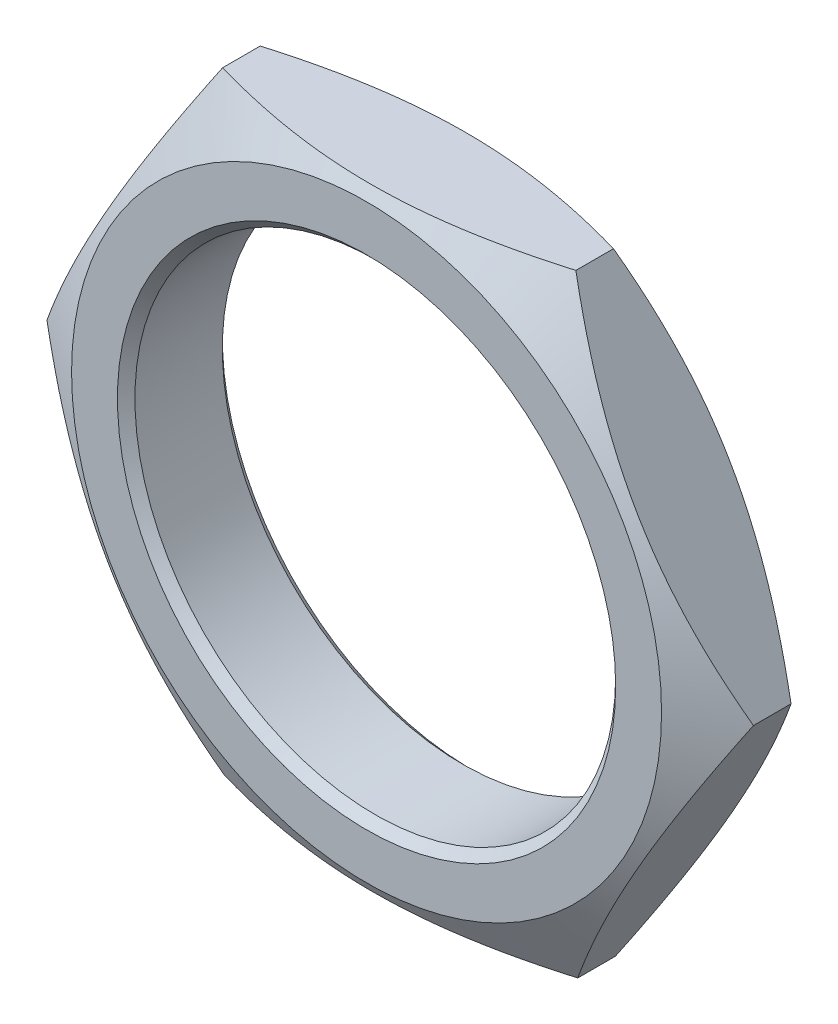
ISO-10303-21;
HEADER;
FILE_DESCRIPTION(('STEP AP214'),'2;1');
FILE_NAME('part.step','',(''),(''),'','','');
FILE_SCHEMA(('AUTOMOTIVE_DESIGN { 1 0 10303 214 1 1 1 1 }'));
ENDSEC;
DATA;
#1=APPLICATION_CONTEXT('core data for automotive mechanical design processes');
#2=APPLICATION_PROTOCOL_DEFINITION('international standard','automotive_design',2000,#1);
#3=PRODUCT_CONTEXT('',#1,'mechanical');
#4=PRODUCT('Part','Part','',(#3));
#5=PRODUCT_RELATED_PRODUCT_CATEGORY('part','',(#4));
#6=PRODUCT_DEFINITION_FORMATION('','',#4);
#7=PRODUCT_DEFINITION_CONTEXT('part definition',#1,'design');
#8=PRODUCT_DEFINITION('design','',#6,#7);
#9=PRODUCT_DEFINITION_SHAPE('','',#8);
#10=(LENGTH_UNIT() NAMED_UNIT(*) SI_UNIT(.MILLI.,.METRE.));
#11=(NAMED_UNIT(*) PLANE_ANGLE_UNIT() SI_UNIT($,.RADIAN.));
#12=(NAMED_UNIT(*) SI_UNIT($,.STERADIAN.) SOLID_ANGLE_UNIT());
#13=UNCERTAINTY_MEASURE_WITH_UNIT(LENGTH_MEASURE(1.E-05),#10,'distance_accuracy_value','');
#14=(GEOMETRIC_REPRESENTATION_CONTEXT(3) GLOBAL_UNCERTAINTY_ASSIGNED_CONTEXT((#13)) GLOBAL_UNIT_ASSIGNED_CONTEXT((#10,
#11,#12)) REPRESENTATION_CONTEXT('',''));
#15=CARTESIAN_POINT('',(0.,0.,0.));
#16=DIRECTION('',(0.,0.,1.));
#17=DIRECTION('',(1.,0.,0.));
#18=AXIS2_PLACEMENT_3D('',#15,#16,#17);
#19=CARTESIAN_POINT('',(-4.01970905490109,-7.01250828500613,2.4));
#20=DIRECTION('',(-0.00310333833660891,0.99999518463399,0.));
#21=DIRECTION('',(-0.99999518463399,-0.00310333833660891,0.));
#22=AXIS2_PLACEMENT_3D('',#19,#20,#21);
#23=PLANE('',#22);
#24=CARTESIAN_POINT('',(4.06335579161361,-6.98742367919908,0.769610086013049));
#25=CARTESIAN_POINT('',(3.88568555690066,-6.98797505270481,0.718328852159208));
#26=CARTESIAN_POINT('',(3.70735288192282,-6.9885284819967,0.669374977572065));
#27=CARTESIAN_POINT('',(3.34923928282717,-6.98963983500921,0.576762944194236));
#28=CARTESIAN_POINT('',(3.16945776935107,-6.99019776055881,0.533107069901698));
#29=CARTESIAN_POINT('',(2.62723473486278,-6.99188047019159,0.410943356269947));
#30=CARTESIAN_POINT('',(2.26265288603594,-6.99301189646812,0.341458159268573));
#31=CARTESIAN_POINT('',(1.7170627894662,-6.99470505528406,0.259978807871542));
#32=CARTESIAN_POINT('',(1.5376846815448,-6.9952617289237,0.236767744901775));
#33=CARTESIAN_POINT('',(1.17811796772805,-6.99637759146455,0.19784628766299));
#34=CARTESIAN_POINT('',(0.997929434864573,-6.9969367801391,0.1821352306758));
#35=CARTESIAN_POINT('',(0.637239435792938,-6.99805612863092,0.158614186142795));
#36=CARTESIAN_POINT('',(0.456738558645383,-6.99861628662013,0.150795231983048));
#37=CARTESIAN_POINT('',(0.0955800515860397,-6.99973708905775,0.143217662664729));
#38=CARTESIAN_POINT('',(-0.0850775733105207,-7.0002977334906,0.143458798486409));
#39=CARTESIAN_POINT('',(-0.580015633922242,-7.00183370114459,0.155198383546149));
#40=CARTESIAN_POINT('',(-0.894134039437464,-7.00280852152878,0.174904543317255));
#41=CARTESIAN_POINT('',(-1.52028451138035,-7.0047516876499,0.237391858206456));
#42=CARTESIAN_POINT('',(-1.83231437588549,-7.00572002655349,0.280194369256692));
#43=CARTESIAN_POINT('',(-2.4597248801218,-7.00766710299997,0.387187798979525));
#44=CARTESIAN_POINT('',(-2.77502635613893,-7.00864559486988,0.451832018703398));
#45=CARTESIAN_POINT('',(-3.40092738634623,-7.01058798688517,0.598548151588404));
#46=CARTESIAN_POINT('',(-3.71153495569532,-7.01155191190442,0.680585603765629));
#47=CARTESIAN_POINT('',(-4.01990905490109,-7.01250890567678,0.769610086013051));
#48=B_SPLINE_CURVE_WITH_KNOTS('',3,(#24,#25,#26,#27,#28,#29,#30,#31,#32,#33,#34,#35,#36,#37,#38,
#39,#40,#41,#42,#43,#44,#45,#46,#47),.UNSPECIFIED.,.F.,.F.,(4,2,2,2,2,2,2,2,2,2,2,4),(0.,
0.554726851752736,1.10969205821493,2.22192844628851,2.76442515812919,3.30687392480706,
3.8487056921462,4.39052071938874,5.3337433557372,6.27783963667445,7.24287417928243,
8.20601428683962),.UNSPECIFIED.);
#49=CARTESIAN_POINT('',(4.06315579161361,-6.98742429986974,0.769552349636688));
#50=VERTEX_POINT('',#49);
#51=CARTESIAN_POINT('',(-4.01970905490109,-7.01250828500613,0.76955234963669));
#52=VERTEX_POINT('',#51);
#53=EDGE_CURVE('E50',#50,#52,#48,.T.);
#54=ORIENTED_EDGE('',*,*,#53,.F.);
#55=DIRECTION('',(0.,0.,-1.));
#56=VECTOR('',#55,1.);
#57=CARTESIAN_POINT('',(4.06315579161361,-6.98742429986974,2.4));
#58=LINE('',#57,#56);
#59=CARTESIAN_POINT('',(4.06315579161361,-6.98742429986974,1.63044765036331));
#60=VERTEX_POINT('',#59);
#61=EDGE_CURVE('E120',#60,#50,#58,.T.);
#62=ORIENTED_EDGE('',*,*,#61,.F.);
#63=CARTESIAN_POINT('',(-4.01990905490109,-7.01250890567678,1.63038991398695));
#64=CARTESIAN_POINT('',(-3.84223882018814,-7.01195753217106,1.68167114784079));
#65=CARTESIAN_POINT('',(-3.6639061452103,-7.01140410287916,1.73062502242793));
#66=CARTESIAN_POINT('',(-3.30579254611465,-7.01029274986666,1.82323705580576));
#67=CARTESIAN_POINT('',(-3.12601103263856,-7.00973482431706,1.8668929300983));
#68=CARTESIAN_POINT('',(-2.58378799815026,-7.00805211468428,1.98905664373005));
#69=CARTESIAN_POINT('',(-2.21920614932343,-7.00692068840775,2.05854184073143));
#70=CARTESIAN_POINT('',(-1.67361605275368,-7.00522752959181,2.14002119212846));
#71=CARTESIAN_POINT('',(-1.49423794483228,-7.00467085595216,2.16323225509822));
#72=CARTESIAN_POINT('',(-1.13467123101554,-7.00355499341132,2.20215371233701));
#73=CARTESIAN_POINT('',(-0.954482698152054,-7.00299580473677,2.2178647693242));
#74=CARTESIAN_POINT('',(-0.59379269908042,-7.00187645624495,2.2413858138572));
#75=CARTESIAN_POINT('',(-0.413291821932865,-7.00131629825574,2.24920476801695));
#76=CARTESIAN_POINT('',(-0.0521333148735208,-7.00019549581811,2.25678233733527));
#77=CARTESIAN_POINT('',(0.128524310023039,-6.99963485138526,2.25654120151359));
#78=CARTESIAN_POINT('',(0.623462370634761,-6.99809888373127,2.24480161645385));
#79=CARTESIAN_POINT('',(0.937580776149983,-6.99712406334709,2.22509545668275));
#80=CARTESIAN_POINT('',(1.56373124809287,-6.99518089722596,2.16260814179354));
#81=CARTESIAN_POINT('',(1.87576111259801,-6.99421255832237,2.11980563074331));
#82=CARTESIAN_POINT('',(2.50317161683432,-6.9922654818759,2.01281220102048));
#83=CARTESIAN_POINT('',(2.81847309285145,-6.99128699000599,1.9481679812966));
#84=CARTESIAN_POINT('',(3.44437412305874,-6.98934459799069,1.8014518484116));
#85=CARTESIAN_POINT('',(3.75498169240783,-6.98838067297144,1.71941439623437));
#86=CARTESIAN_POINT('',(4.06335579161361,-6.98742367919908,1.63038991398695));
#87=B_SPLINE_CURVE_WITH_KNOTS('',3,(#63,#64,#65,#66,#67,#68,#69,#70,#71,#72,#73,#74,#75,#76,#77,
#78,#79,#80,#81,#82,#83,#84,#85,#86),.UNSPECIFIED.,.F.,.F.,(4,2,2,2,2,2,2,2,2,2,2,4),(0.,
0.554726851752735,1.10969205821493,2.22192844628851,2.76442515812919,3.30687392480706,
3.8487056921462,4.39052071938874,5.3337433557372,6.27783963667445,7.24287417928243,
8.20601428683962),.UNSPECIFIED.);
#88=CARTESIAN_POINT('',(-4.01970905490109,-7.01250828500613,1.63044765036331));
#89=VERTEX_POINT('',#88);
#90=EDGE_CURVE('E111',#89,#60,#87,.T.);
#91=ORIENTED_EDGE('',*,*,#90,.F.);
#92=DIRECTION('',(0.,0.,-1.));
#93=VECTOR('',#92,1.);
#94=CARTESIAN_POINT('',(-4.01970905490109,-7.01250828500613,2.4));
#95=LINE('',#94,#93);
#96=EDGE_CURVE('E107',#89,#52,#95,.T.);
#97=ORIENTED_EDGE('',*,*,#96,.T.);
#98=EDGE_LOOP('',(#54,#62,#91,#97));
#99=FACE_BOUND('',#98,.T.);
#100=ADVANCED_FACE('F35',(#99),#23,.F.);
#101=CARTESIAN_POINT('',(4.06315579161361,-6.98742429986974,2.4));
#102=DIRECTION('',(-0.86757290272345,0.497310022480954,0.));
#103=DIRECTION('',(-0.497310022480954,-0.86757290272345,0.));
#104=AXIS2_PLACEMENT_3D('',#101,#102,#103);
#105=PLANE('',#104);
#106=CARTESIAN_POINT('',(8.08297949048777,0.0252839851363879,0.769618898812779));
#107=CARTESIAN_POINT('',(7.99462174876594,-0.128858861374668,0.718337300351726));
#108=CARTESIAN_POINT('',(7.90593456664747,-0.283576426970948,0.669383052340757));
#109=CARTESIAN_POINT('',(7.72783996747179,-0.5942680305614,0.57677025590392));
#110=CARTESIAN_POINT('',(7.63843225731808,-0.750242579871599,0.533113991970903));
#111=CARTESIAN_POINT('',(7.36877760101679,-1.22066356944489,0.410949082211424));
#112=CARTESIAN_POINT('',(7.18746623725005,-1.53696691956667,0.341463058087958));
#113=CARTESIAN_POINT('',(6.91613708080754,-2.01030912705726,0.259982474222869));
#114=CARTESIAN_POINT('',(6.82692998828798,-2.16593369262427,0.236771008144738));
#115=CARTESIAN_POINT('',(6.64811272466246,-2.47788600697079,0.19784874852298));
#116=CARTESIAN_POINT('',(6.55850258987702,-2.63421369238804,0.182137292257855));
#117=CARTESIAN_POINT('',(6.37912668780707,-2.94714056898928,0.158615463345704));
#118=CARTESIAN_POINT('',(6.28936121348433,-3.10373924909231,0.150796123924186));
#119=CARTESIAN_POINT('',(6.10975230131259,-3.41707261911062,0.143217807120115));
#120=CARTESIAN_POINT('',(6.01990886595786,-3.57380730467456,0.143458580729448));
#121=CARTESIAN_POINT('',(5.77376761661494,-4.00320841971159,0.155197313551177));
#122=CARTESIAN_POINT('',(5.61755037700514,-4.27573428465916,0.174903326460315));
#123=CARTESIAN_POINT('',(5.30615347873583,-4.81897592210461,0.237391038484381));
#124=CARTESIAN_POINT('',(5.15097491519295,-5.08968978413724,0.28019409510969));
#125=CARTESIAN_POINT('',(4.83895134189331,-5.63402467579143,0.38718922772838));
#126=CARTESIAN_POINT('',(4.68214570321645,-5.90757702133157,0.451834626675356));
#127=CARTESIAN_POINT('',(4.37087282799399,-6.45060229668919,0.598553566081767));
#128=CARTESIAN_POINT('',(4.21640160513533,-6.7200821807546,0.680592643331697));
#129=CARTESIAN_POINT('',(4.06304114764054,-6.98762429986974,0.769618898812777));
#130=B_SPLINE_CURVE_WITH_KNOTS('',3,(#106,#107,#108,#109,#110,#111,#112,#113,#114,#115,#116,
#117,#118,#119,#120,#121,#122,#123,#124,#125,#126,#127,#128,#129),.UNSPECIFIED.,.F.,.F.,(4,2,2,
2,2,2,2,2,2,2,2,4),(0.,0.554727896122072,1.10969414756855,2.22193268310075,2.76443034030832,
3.30688005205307,3.84871275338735,4.39052871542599,5.33376486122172,6.27787470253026,
7.24292352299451,8.20607780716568),.UNSPECIFIED.);
#131=CARTESIAN_POINT('',(8.0828648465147,0.025083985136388,0.76955234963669));
#132=VERTEX_POINT('',#131);
#133=EDGE_CURVE('E184',#132,#50,#130,.T.);
#134=ORIENTED_EDGE('',*,*,#133,.F.);
#135=DIRECTION('',(0.,0.,-1.));
#136=VECTOR('',#135,1.);
#137=CARTESIAN_POINT('',(8.0828648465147,0.0250839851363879,2.4));
#138=LINE('',#137,#136);
#139=CARTESIAN_POINT('',(8.0828648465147,0.0250839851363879,1.63044765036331));
#140=VERTEX_POINT('',#139);
#141=EDGE_CURVE('E117',#140,#132,#138,.T.);
#142=ORIENTED_EDGE('',*,*,#141,.F.);
#143=CARTESIAN_POINT('',(4.06304114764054,-6.98762429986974,1.63038110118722));
#144=CARTESIAN_POINT('',(4.15139888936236,-6.83348145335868,1.68166269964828));
#145=CARTESIAN_POINT('',(4.24008607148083,-6.6787638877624,1.73061694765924));
#146=CARTESIAN_POINT('',(4.41818067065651,-6.36807228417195,1.82322974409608));
#147=CARTESIAN_POINT('',(4.50758838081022,-6.21209773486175,1.8668860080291));
#148=CARTESIAN_POINT('',(4.77724303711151,-5.74167674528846,1.98905091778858));
#149=CARTESIAN_POINT('',(4.95855440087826,-5.42537339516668,2.05853694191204));
#150=CARTESIAN_POINT('',(5.22988355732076,-4.95203118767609,2.14001752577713));
#151=CARTESIAN_POINT('',(5.31909064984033,-4.79640662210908,2.16322899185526));
#152=CARTESIAN_POINT('',(5.49790791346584,-4.48445430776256,2.20215125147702));
#153=CARTESIAN_POINT('',(5.58751804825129,-4.32812662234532,2.21786270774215));
#154=CARTESIAN_POINT('',(5.76689395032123,-4.01519974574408,2.2413845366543));
#155=CARTESIAN_POINT('',(5.85665942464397,-3.85860106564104,2.24920387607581));
#156=CARTESIAN_POINT('',(6.03626833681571,-3.54526769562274,2.25678219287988));
#157=CARTESIAN_POINT('',(6.12611177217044,-3.38853301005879,2.25654141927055));
#158=CARTESIAN_POINT('',(6.37225302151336,-2.95913189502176,2.24480268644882));
#159=CARTESIAN_POINT('',(6.52847026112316,-2.68660603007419,2.22509667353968));
#160=CARTESIAN_POINT('',(6.83986715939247,-2.14336439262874,2.16260896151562));
#161=CARTESIAN_POINT('',(6.99504572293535,-1.87265053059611,2.11980590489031));
#162=CARTESIAN_POINT('',(7.30706929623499,-1.32831563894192,2.01281077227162));
#163=CARTESIAN_POINT('',(7.46387493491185,-1.05476329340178,1.94816537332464));
#164=CARTESIAN_POINT('',(7.77514781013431,-0.511738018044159,1.80144643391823));
#165=CARTESIAN_POINT('',(7.92961903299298,-0.242258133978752,1.7194073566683));
#166=CARTESIAN_POINT('',(8.08297949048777,0.0252839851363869,1.63038110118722));
#167=B_SPLINE_CURVE_WITH_KNOTS('',3,(#143,#144,#145,#146,#147,#148,#149,#150,#151,#152,#153,
#154,#155,#156,#157,#158,#159,#160,#161,#162,#163,#164,#165,#166),.UNSPECIFIED.,.F.,.F.,(4,2,2,
2,2,2,2,2,2,2,2,4),(0.,0.554727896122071,1.10969414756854,2.22193268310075,2.76443034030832,
3.30688005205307,3.84871275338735,4.39052871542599,5.33376486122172,6.27787470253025,
7.24292352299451,8.20607780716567),.UNSPECIFIED.);
#168=EDGE_CURVE('E166',#60,#140,#167,.T.);
#169=ORIENTED_EDGE('',*,*,#168,.F.);
#170=ORIENTED_EDGE('',*,*,#61,.T.);
#171=EDGE_LOOP('',(#134,#142,#169,#170));
#172=FACE_BOUND('',#171,.T.);
#173=ADVANCED_FACE('F175',(#172),#105,.F.);
#174=CARTESIAN_POINT('',(8.0828648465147,0.0250839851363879,2.4));
#175=DIRECTION('',(-0.864469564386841,-0.502685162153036,0.));
#176=DIRECTION('',(0.502685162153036,-0.864469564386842,0.));
#177=AXIS2_PLACEMENT_3D('',#174,#175,#176);
#178=PLANE('',#177);
#179=CARTESIAN_POINT('',(4.01959275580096,7.01270828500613,0.769619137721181));
#180=CARTESIAN_POINT('',(4.10890550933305,6.85911680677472,0.718337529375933));
#181=CARTESIAN_POINT('',(4.19855126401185,6.70495266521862,0.669383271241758));
#182=CARTESIAN_POINT('',(4.37857079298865,6.39537240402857,0.576770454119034));
#183=CARTESIAN_POINT('',(4.46894486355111,6.23995577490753,0.533114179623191));
#184=CARTESIAN_POINT('',(4.74151407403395,5.77121747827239,0.410949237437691));
#185=CARTESIAN_POINT('',(4.92478513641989,5.45604554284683,0.341463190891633));
#186=CARTESIAN_POINT('',(5.19904694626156,4.984396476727,0.259982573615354));
#187=CARTESIAN_POINT('',(5.2892182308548,4.82932857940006,0.236771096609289));
#188=CARTESIAN_POINT('',(5.46996823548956,4.51849211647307,0.197848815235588));
#189=CARTESIAN_POINT('',(5.56054691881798,4.36272361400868,0.182137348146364));
#190=CARTESIAN_POINT('',(5.74186160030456,4.05091607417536,0.15861549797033));
#191=CARTESIAN_POINT('',(5.83259730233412,3.89487754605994,0.150796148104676));
#192=CARTESIAN_POINT('',(6.01414751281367,3.5826649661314,0.143217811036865));
#193=CARTESIAN_POINT('',(6.10496201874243,3.42649091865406,0.143458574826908));
#194=CARTESIAN_POINT('',(6.35376373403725,2.9986256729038,0.155197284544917));
#195=CARTESIAN_POINT('',(6.51166949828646,2.72707453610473,0.174903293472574));
#196=CARTESIAN_POINT('',(6.82643223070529,2.18577588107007,0.237391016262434));
#197=CARTESIAN_POINT('',(6.98328809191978,1.91603026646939,0.280194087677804));
#198=CARTESIAN_POINT('',(7.29868427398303,1.37364226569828,0.387189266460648));
#199=CARTESIAN_POINT('',(7.45718479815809,1.10106831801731,0.451834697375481));
#200=CARTESIAN_POINT('',(7.77182216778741,0.559985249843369,0.598553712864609));
#201=CARTESIAN_POINT('',(7.92796304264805,0.29146919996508,0.680592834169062));
#202=CARTESIAN_POINT('',(8.08298114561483,0.0248839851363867,0.769619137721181));
#203=B_SPLINE_CURVE_WITH_KNOTS('',3,(#179,#180,#181,#182,#183,#184,#185,#186,#187,#188,#189,
#190,#191,#192,#193,#194,#195,#196,#197,#198,#199,#200,#201,#202),.UNSPECIFIED.,.F.,.F.,(4,2,2,
2,2,2,2,2,2,2,2,4),(0.,0.554727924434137,1.10969420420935,2.22193279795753,2.76443048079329,
3.30688021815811,3.8487129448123,4.39052893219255,5.33376544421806,6.2778756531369,
7.24292486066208,8.20607952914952),.UNSPECIFIED.);
#204=CARTESIAN_POINT('',(4.01970905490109,7.01250828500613,0.76955234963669));
#205=VERTEX_POINT('',#204);
#206=EDGE_CURVE('E190',#205,#132,#203,.T.);
#207=ORIENTED_EDGE('',*,*,#206,.F.);
#208=DIRECTION('',(0.,0.,-1.));
#209=VECTOR('',#208,1.);
#210=CARTESIAN_POINT('',(4.01970905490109,7.01250828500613,2.4));
#211=LINE('',#210,#209);
#212=CARTESIAN_POINT('',(4.01970905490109,7.01250828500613,1.63044765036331));
#213=VERTEX_POINT('',#212);
#214=EDGE_CURVE('E109',#213,#205,#211,.T.);
#215=ORIENTED_EDGE('',*,*,#214,.F.);
#216=CARTESIAN_POINT('',(8.08298114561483,0.0248839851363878,1.63038086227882));
#217=CARTESIAN_POINT('',(7.99366839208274,0.178475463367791,1.68166247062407));
#218=CARTESIAN_POINT('',(7.90402263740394,0.332639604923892,1.73061672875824));
#219=CARTESIAN_POINT('',(7.72400310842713,0.642219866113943,1.82322954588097));
#220=CARTESIAN_POINT('',(7.63362903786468,0.797636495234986,1.86688582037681));
#221=CARTESIAN_POINT('',(7.36105982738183,1.26637479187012,1.98905076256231));
#222=CARTESIAN_POINT('',(7.1777887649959,1.58154672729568,2.05853680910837));
#223=CARTESIAN_POINT('',(6.90352695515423,2.05319579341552,2.14001742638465));
#224=CARTESIAN_POINT('',(6.81335567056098,2.20826369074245,2.16322890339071));
#225=CARTESIAN_POINT('',(6.63260566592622,2.51910015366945,2.20215118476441));
#226=CARTESIAN_POINT('',(6.54202698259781,2.67486865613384,2.21786265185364));
#227=CARTESIAN_POINT('',(6.36071230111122,2.98667619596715,2.24138450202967));
#228=CARTESIAN_POINT('',(6.26997659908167,3.14271472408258,2.24920385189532));
#229=CARTESIAN_POINT('',(6.08842638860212,3.45492730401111,2.25678218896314));
#230=CARTESIAN_POINT('',(5.99761188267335,3.61110135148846,2.25654142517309));
#231=CARTESIAN_POINT('',(5.74881016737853,4.03896659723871,2.24480271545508));
#232=CARTESIAN_POINT('',(5.59090440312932,4.31051773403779,2.22509670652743));
#233=CARTESIAN_POINT('',(5.27614167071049,4.85181638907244,2.16260898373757));
#234=CARTESIAN_POINT('',(5.119285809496,5.12156200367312,2.1198059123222));
#235=CARTESIAN_POINT('',(4.80388962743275,5.66395000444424,2.01281073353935));
#236=CARTESIAN_POINT('',(4.6453891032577,5.9365239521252,1.94816530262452));
#237=CARTESIAN_POINT('',(4.33075173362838,6.47760702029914,1.80144628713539));
#238=CARTESIAN_POINT('',(4.17461085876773,6.74612307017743,1.71940716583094));
#239=CARTESIAN_POINT('',(4.01959275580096,7.01270828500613,1.63038086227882));
#240=B_SPLINE_CURVE_WITH_KNOTS('',3,(#216,#217,#218,#219,#220,#221,#222,#223,#224,#225,#226,
#227,#228,#229,#230,#231,#232,#233,#234,#235,#236,#237,#238,#239),.UNSPECIFIED.,.F.,.F.,(4,2,2,
2,2,2,2,2,2,2,2,4),(0.,0.554727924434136,1.10969420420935,2.22193279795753,2.7644304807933,
3.30688021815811,3.8487129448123,4.39052893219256,5.33376544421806,6.2778756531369,
7.24292486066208,8.20607952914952),.UNSPECIFIED.);
#241=EDGE_CURVE('E160',#140,#213,#240,.T.);
#242=ORIENTED_EDGE('',*,*,#241,.F.);
#243=ORIENTED_EDGE('',*,*,#141,.T.);
#244=EDGE_LOOP('',(#207,#215,#242,#243));
#245=FACE_BOUND('',#244,.T.);
#246=ADVANCED_FACE('F178',(#245),#178,.F.);
#247=CARTESIAN_POINT('',(4.01970905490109,7.01250828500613,2.4));
#248=DIRECTION('',(0.00310333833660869,-0.99999518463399,0.));
#249=DIRECTION('',(0.99999518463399,0.00310333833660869,0.));
#250=AXIS2_PLACEMENT_3D('',#247,#248,#249);
#251=PLANE('',#250);
#252=CARTESIAN_POINT('',(-4.06335579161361,6.98742367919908,0.76961008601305));
#253=CARTESIAN_POINT('',(-3.88568555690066,6.98797505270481,0.718328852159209));
#254=CARTESIAN_POINT('',(-3.70735288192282,6.9885284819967,0.669374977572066));
#255=CARTESIAN_POINT('',(-3.34923928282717,6.98963983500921,0.576762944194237));
#256=CARTESIAN_POINT('',(-3.16945776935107,6.99019776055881,0.533107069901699));
#257=CARTESIAN_POINT('',(-2.62723473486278,6.99188047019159,0.410943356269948));
#258=CARTESIAN_POINT('',(-2.26265288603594,6.99301189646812,0.341458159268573));
#259=CARTESIAN_POINT('',(-1.7170627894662,6.99470505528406,0.259978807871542));
#260=CARTESIAN_POINT('',(-1.5376846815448,6.99526172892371,0.236767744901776));
#261=CARTESIAN_POINT('',(-1.17811796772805,6.99637759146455,0.197846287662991));
#262=CARTESIAN_POINT('',(-0.997929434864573,6.9969367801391,0.1821352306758));
#263=CARTESIAN_POINT('',(-0.637239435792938,6.99805612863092,0.158614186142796));
#264=CARTESIAN_POINT('',(-0.456738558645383,6.99861628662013,0.150795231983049));
#265=CARTESIAN_POINT('',(-0.0955800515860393,6.99973708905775,0.143217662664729));
#266=CARTESIAN_POINT('',(0.085077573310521,7.0002977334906,0.143458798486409));
#267=CARTESIAN_POINT('',(0.580015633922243,7.00183370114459,0.15519838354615));
#268=CARTESIAN_POINT('',(0.894134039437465,7.00280852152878,0.174904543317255));
#269=CARTESIAN_POINT('',(1.52028451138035,7.0047516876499,0.237391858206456));
#270=CARTESIAN_POINT('',(1.83231437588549,7.00572002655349,0.280194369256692));
#271=CARTESIAN_POINT('',(2.4597248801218,7.00766710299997,0.387187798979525));
#272=CARTESIAN_POINT('',(2.77502635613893,7.00864559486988,0.451832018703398));
#273=CARTESIAN_POINT('',(3.40092738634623,7.01058798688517,0.598548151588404));
#274=CARTESIAN_POINT('',(3.71153495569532,7.01155191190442,0.680585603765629));
#275=CARTESIAN_POINT('',(4.01990905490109,7.01250890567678,0.769610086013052));
#276=B_SPLINE_CURVE_WITH_KNOTS('',3,(#252,#253,#254,#255,#256,#257,#258,#259,#260,#261,#262,
#263,#264,#265,#266,#267,#268,#269,#270,#271,#272,#273,#274,#275),.UNSPECIFIED.,.F.,.F.,(4,2,2,
2,2,2,2,2,2,2,2,4),(0.,0.554726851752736,1.10969205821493,2.22192844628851,2.76442515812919,
3.30687392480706,3.8487056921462,4.39052071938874,5.3337433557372,6.27783963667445,
7.24287417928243,8.20601428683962),.UNSPECIFIED.);
#277=CARTESIAN_POINT('',(-4.06315579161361,6.98742429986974,0.769552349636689));
#278=VERTEX_POINT('',#277);
#279=EDGE_CURVE('E103',#278,#205,#276,.T.);
#280=ORIENTED_EDGE('',*,*,#279,.F.);
#281=DIRECTION('',(0.,0.,-1.));
#282=VECTOR('',#281,1.);
#283=CARTESIAN_POINT('',(-4.06315579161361,6.98742429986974,2.4));
#284=LINE('',#283,#282);
#285=CARTESIAN_POINT('',(-4.06315579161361,6.98742429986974,1.63044765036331));
#286=VERTEX_POINT('',#285);
#287=EDGE_CURVE('E102',#286,#278,#284,.T.);
#288=ORIENTED_EDGE('',*,*,#287,.F.);
#289=CARTESIAN_POINT('',(4.01990905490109,7.01250890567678,1.63038991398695));
#290=CARTESIAN_POINT('',(3.84223882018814,7.01195753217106,1.68167114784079));
#291=CARTESIAN_POINT('',(3.6639061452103,7.01140410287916,1.73062502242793));
#292=CARTESIAN_POINT('',(3.30579254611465,7.01029274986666,1.82323705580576));
#293=CARTESIAN_POINT('',(3.12601103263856,7.00973482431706,1.8668929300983));
#294=CARTESIAN_POINT('',(2.58378799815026,7.00805211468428,1.98905664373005));
#295=CARTESIAN_POINT('',(2.21920614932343,7.00692068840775,2.05854184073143));
#296=CARTESIAN_POINT('',(1.67361605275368,7.00522752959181,2.14002119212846));
#297=CARTESIAN_POINT('',(1.49423794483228,7.00467085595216,2.16323225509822));
#298=CARTESIAN_POINT('',(1.13467123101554,7.00355499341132,2.20215371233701));
#299=CARTESIAN_POINT('',(0.954482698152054,7.00299580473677,2.2178647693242));
#300=CARTESIAN_POINT('',(0.593792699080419,7.00187645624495,2.2413858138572));
#301=CARTESIAN_POINT('',(0.413291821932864,7.00131629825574,2.24920476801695));
#302=CARTESIAN_POINT('',(0.0521333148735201,7.00019549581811,2.25678233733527));
#303=CARTESIAN_POINT('',(-0.12852431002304,6.99963485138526,2.25654120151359));
#304=CARTESIAN_POINT('',(-0.623462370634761,6.99809888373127,2.24480161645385));
#305=CARTESIAN_POINT('',(-0.937580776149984,6.99712406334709,2.22509545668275));
#306=CARTESIAN_POINT('',(-1.56373124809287,6.99518089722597,2.16260814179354));
#307=CARTESIAN_POINT('',(-1.87576111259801,6.99421255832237,2.11980563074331));
#308=CARTESIAN_POINT('',(-2.50317161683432,6.9922654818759,2.01281220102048));
#309=CARTESIAN_POINT('',(-2.81847309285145,6.99128699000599,1.9481679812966));
#310=CARTESIAN_POINT('',(-3.44437412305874,6.9893445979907,1.8014518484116));
#311=CARTESIAN_POINT('',(-3.75498169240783,6.98838067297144,1.71941439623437));
#312=CARTESIAN_POINT('',(-4.06335579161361,6.98742367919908,1.63038991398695));
#313=B_SPLINE_CURVE_WITH_KNOTS('',3,(#289,#290,#291,#292,#293,#294,#295,#296,#297,#298,#299,
#300,#301,#302,#303,#304,#305,#306,#307,#308,#309,#310,#311,#312),.UNSPECIFIED.,.F.,.F.,(4,2,2,
2,2,2,2,2,2,2,2,4),(0.,0.554726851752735,1.10969205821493,2.22192844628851,2.76442515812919,
3.30687392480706,3.84870569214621,4.39052071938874,5.3337433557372,6.27783963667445,
7.24287417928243,8.20601428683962),.UNSPECIFIED.);
#314=EDGE_CURVE('E154',#213,#286,#313,.T.);
#315=ORIENTED_EDGE('',*,*,#314,.F.);
#316=ORIENTED_EDGE('',*,*,#214,.T.);
#317=EDGE_LOOP('',(#280,#288,#315,#316));
#318=FACE_BOUND('',#317,.T.);
#319=ADVANCED_FACE('F209',(#318),#251,.F.);
#320=CARTESIAN_POINT('',(-4.06315579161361,6.98742429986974,2.4));
#321=DIRECTION('',(0.86757290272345,-0.497310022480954,0.));
#322=DIRECTION('',(0.497310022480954,0.86757290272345,0.));
#323=AXIS2_PLACEMENT_3D('',#320,#321,#322);
#324=PLANE('',#323);
#325=CARTESIAN_POINT('',(-8.08297949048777,-0.025283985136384,0.769618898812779));
#326=CARTESIAN_POINT('',(-7.99462174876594,0.128858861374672,0.718337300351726));
#327=CARTESIAN_POINT('',(-7.90593456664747,0.283576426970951,0.669383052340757));
#328=CARTESIAN_POINT('',(-7.72783996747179,0.594268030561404,0.57677025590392));
#329=CARTESIAN_POINT('',(-7.63843225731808,0.750242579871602,0.533113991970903));
#330=CARTESIAN_POINT('',(-7.36877760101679,1.22066356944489,0.410949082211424));
#331=CARTESIAN_POINT('',(-7.18746623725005,1.53696691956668,0.341463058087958));
#332=CARTESIAN_POINT('',(-6.91613708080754,2.01030912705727,0.259982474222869));
#333=CARTESIAN_POINT('',(-6.82692998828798,2.16593369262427,0.236771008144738));
#334=CARTESIAN_POINT('',(-6.64811272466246,2.47788600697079,0.197848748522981));
#335=CARTESIAN_POINT('',(-6.55850258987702,2.63421369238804,0.182137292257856));
#336=CARTESIAN_POINT('',(-6.37912668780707,2.94714056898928,0.158615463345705));
#337=CARTESIAN_POINT('',(-6.28936121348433,3.10373924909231,0.150796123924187));
#338=CARTESIAN_POINT('',(-6.10975230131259,3.41707261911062,0.143217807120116));
#339=CARTESIAN_POINT('',(-6.01990886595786,3.57380730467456,0.143458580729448));
#340=CARTESIAN_POINT('',(-5.77376761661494,4.0032084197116,0.155197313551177));
#341=CARTESIAN_POINT('',(-5.61755037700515,4.27573428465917,0.174903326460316));
#342=CARTESIAN_POINT('',(-5.30615347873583,4.81897592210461,0.237391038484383));
#343=CARTESIAN_POINT('',(-5.15097491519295,5.08968978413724,0.280194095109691));
#344=CARTESIAN_POINT('',(-4.83895134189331,5.63402467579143,0.387189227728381));
#345=CARTESIAN_POINT('',(-4.68214570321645,5.90757702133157,0.451834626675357));
#346=CARTESIAN_POINT('',(-4.37087282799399,6.45060229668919,0.598553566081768));
#347=CARTESIAN_POINT('',(-4.21640160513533,6.7200821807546,0.680592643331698));
#348=CARTESIAN_POINT('',(-4.06304114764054,6.98762429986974,0.769618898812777));
#349=B_SPLINE_CURVE_WITH_KNOTS('',3,(#325,#326,#327,#328,#329,#330,#331,#332,#333,#334,#335,
#336,#337,#338,#339,#340,#341,#342,#343,#344,#345,#346,#347,#348),.UNSPECIFIED.,.F.,.F.,(4,2,2,
2,2,2,2,2,2,2,2,4),(0.,0.554727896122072,1.10969414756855,2.22193268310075,2.76443034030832,
3.30688005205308,3.84871275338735,4.39052871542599,5.33376486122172,6.27787470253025,
7.24292352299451,8.20607780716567),.UNSPECIFIED.);
#350=CARTESIAN_POINT('',(-8.0828648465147,-0.0250839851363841,0.76955234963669));
#351=VERTEX_POINT('',#350);
#352=EDGE_CURVE('E88',#351,#278,#349,.T.);
#353=ORIENTED_EDGE('',*,*,#352,.F.);
#354=DIRECTION('',(0.,0.,-1.));
#355=VECTOR('',#354,1.);
#356=CARTESIAN_POINT('',(-8.0828648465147,-0.025083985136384,2.4));
#357=LINE('',#356,#355);
#358=CARTESIAN_POINT('',(-8.0828648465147,-0.025083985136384,1.63044765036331));
#359=VERTEX_POINT('',#358);
#360=EDGE_CURVE('E100',#359,#351,#357,.T.);
#361=ORIENTED_EDGE('',*,*,#360,.F.);
#362=CARTESIAN_POINT('',(-4.06304114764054,6.98762429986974,1.63038110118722));
#363=CARTESIAN_POINT('',(-4.15139888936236,6.83348145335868,1.68166269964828));
#364=CARTESIAN_POINT('',(-4.24008607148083,6.67876388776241,1.73061694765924));
#365=CARTESIAN_POINT('',(-4.41818067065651,6.36807228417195,1.82322974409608));
#366=CARTESIAN_POINT('',(-4.50758838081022,6.21209773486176,1.8668860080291));
#367=CARTESIAN_POINT('',(-4.77724303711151,5.74167674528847,1.98905091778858));
#368=CARTESIAN_POINT('',(-4.95855440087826,5.42537339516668,2.05853694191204));
#369=CARTESIAN_POINT('',(-5.22988355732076,4.95203118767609,2.14001752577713));
#370=CARTESIAN_POINT('',(-5.31909064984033,4.79640662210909,2.16322899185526));
#371=CARTESIAN_POINT('',(-5.49790791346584,4.48445430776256,2.20215125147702));
#372=CARTESIAN_POINT('',(-5.58751804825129,4.32812662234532,2.21786270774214));
#373=CARTESIAN_POINT('',(-5.76689395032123,4.01519974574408,2.24138453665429));
#374=CARTESIAN_POINT('',(-5.85665942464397,3.85860106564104,2.24920387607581));
#375=CARTESIAN_POINT('',(-6.03626833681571,3.54526769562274,2.25678219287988));
#376=CARTESIAN_POINT('',(-6.12611177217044,3.3885330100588,2.25654141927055));
#377=CARTESIAN_POINT('',(-6.37225302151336,2.95913189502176,2.24480268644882));
#378=CARTESIAN_POINT('',(-6.52847026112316,2.68660603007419,2.22509667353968));
#379=CARTESIAN_POINT('',(-6.83986715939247,2.14336439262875,2.16260896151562));
#380=CARTESIAN_POINT('',(-6.99504572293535,1.87265053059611,2.11980590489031));
#381=CARTESIAN_POINT('',(-7.30706929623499,1.32831563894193,2.01281077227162));
#382=CARTESIAN_POINT('',(-7.46387493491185,1.05476329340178,1.94816537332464));
#383=CARTESIAN_POINT('',(-7.77514781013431,0.511738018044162,1.80144643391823));
#384=CARTESIAN_POINT('',(-7.92961903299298,0.242258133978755,1.7194073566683));
#385=CARTESIAN_POINT('',(-8.08297949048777,-0.0252839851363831,1.63038110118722));
#386=B_SPLINE_CURVE_WITH_KNOTS('',3,(#362,#363,#364,#365,#366,#367,#368,#369,#370,#371,#372,
#373,#374,#375,#376,#377,#378,#379,#380,#381,#382,#383,#384,#385),.UNSPECIFIED.,.F.,.F.,(4,2,2,
2,2,2,2,2,2,2,2,4),(0.,0.554727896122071,1.10969414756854,2.22193268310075,2.76443034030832,
3.30688005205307,3.84871275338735,4.39052871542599,5.33376486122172,6.27787470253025,
7.24292352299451,8.20607780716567),.UNSPECIFIED.);
#387=EDGE_CURVE('E58',#286,#359,#386,.T.);
#388=ORIENTED_EDGE('',*,*,#387,.F.);
#389=ORIENTED_EDGE('',*,*,#287,.T.);
#390=EDGE_LOOP('',(#353,#361,#388,#389));
#391=FACE_BOUND('',#390,.T.);
#392=ADVANCED_FACE('F99',(#391),#324,.F.);
#393=CARTESIAN_POINT('',(-8.0828648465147,-0.025083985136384,2.4));
#394=DIRECTION('',(0.864469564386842,0.502685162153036,0.));
#395=DIRECTION('',(-0.502685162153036,0.864469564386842,0.));
#396=AXIS2_PLACEMENT_3D('',#393,#394,#395);
#397=PLANE('',#396);
#398=CARTESIAN_POINT('',(-4.01959275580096,-7.01270828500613,0.769619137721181));
#399=CARTESIAN_POINT('',(-4.10890550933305,-6.85911680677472,0.718337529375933));
#400=CARTESIAN_POINT('',(-4.19855126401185,-6.70495266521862,0.669383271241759));
#401=CARTESIAN_POINT('',(-4.37857079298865,-6.39537240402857,0.576770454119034));
#402=CARTESIAN_POINT('',(-4.4689448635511,-6.23995577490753,0.533114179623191));
#403=CARTESIAN_POINT('',(-4.74151407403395,-5.77121747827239,0.41094923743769));
#404=CARTESIAN_POINT('',(-4.92478513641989,-5.45604554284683,0.341463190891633));
#405=CARTESIAN_POINT('',(-5.19904694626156,-4.984396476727,0.259982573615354));
#406=CARTESIAN_POINT('',(-5.2892182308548,-4.82932857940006,0.236771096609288));
#407=CARTESIAN_POINT('',(-5.46996823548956,-4.51849211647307,0.197848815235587));
#408=CARTESIAN_POINT('',(-5.56054691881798,-4.36272361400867,0.182137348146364));
#409=CARTESIAN_POINT('',(-5.74186160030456,-4.05091607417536,0.15861549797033));
#410=CARTESIAN_POINT('',(-5.83259730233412,-3.89487754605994,0.150796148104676));
#411=CARTESIAN_POINT('',(-6.01414751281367,-3.5826649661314,0.143217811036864));
#412=CARTESIAN_POINT('',(-6.10496201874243,-3.42649091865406,0.143458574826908));
#413=CARTESIAN_POINT('',(-6.35376373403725,-2.9986256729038,0.155197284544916));
#414=CARTESIAN_POINT('',(-6.51166949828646,-2.72707453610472,0.174903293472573));
#415=CARTESIAN_POINT('',(-6.82643223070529,-2.18577588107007,0.237391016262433));
#416=CARTESIAN_POINT('',(-6.98328809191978,-1.91603026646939,0.280194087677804));
#417=CARTESIAN_POINT('',(-7.29868427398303,-1.37364226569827,0.387189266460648));
#418=CARTESIAN_POINT('',(-7.45718479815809,-1.10106831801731,0.451834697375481));
#419=CARTESIAN_POINT('',(-7.77182216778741,-0.559985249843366,0.598553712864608));
#420=CARTESIAN_POINT('',(-7.92796304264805,-0.291469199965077,0.680592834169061));
#421=CARTESIAN_POINT('',(-8.08298114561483,-0.0248839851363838,0.769619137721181));
#422=B_SPLINE_CURVE_WITH_KNOTS('',3,(#398,#399,#400,#401,#402,#403,#404,#405,#406,#407,#408,
#409,#410,#411,#412,#413,#414,#415,#416,#417,#418,#419,#420,#421),.UNSPECIFIED.,.F.,.F.,(4,2,2,
2,2,2,2,2,2,2,2,4),(0.,0.554727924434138,1.10969420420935,2.22193279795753,2.7644304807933,
3.30688021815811,3.8487129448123,4.39052893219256,5.33376544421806,6.2778756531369,
7.24292486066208,8.20607952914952),.UNSPECIFIED.);
#423=EDGE_CURVE('E85',#52,#351,#422,.T.);
#424=ORIENTED_EDGE('',*,*,#423,.F.);
#425=ORIENTED_EDGE('',*,*,#96,.F.);
#426=CARTESIAN_POINT('',(-8.08298114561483,-0.0248839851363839,1.63038086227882));
#427=CARTESIAN_POINT('',(-7.99366839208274,-0.178475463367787,1.68166247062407));
#428=CARTESIAN_POINT('',(-7.90402263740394,-0.332639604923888,1.73061672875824));
#429=CARTESIAN_POINT('',(-7.72400310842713,-0.64221986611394,1.82322954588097));
#430=CARTESIAN_POINT('',(-7.63362903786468,-0.797636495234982,1.86688582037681));
#431=CARTESIAN_POINT('',(-7.36105982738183,-1.26637479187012,1.98905076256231));
#432=CARTESIAN_POINT('',(-7.1777887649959,-1.58154672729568,2.05853680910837));
#433=CARTESIAN_POINT('',(-6.90352695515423,-2.05319579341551,2.14001742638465));
#434=CARTESIAN_POINT('',(-6.81335567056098,-2.20826369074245,2.16322890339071));
#435=CARTESIAN_POINT('',(-6.63260566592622,-2.51910015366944,2.20215118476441));
#436=CARTESIAN_POINT('',(-6.54202698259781,-2.67486865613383,2.21786265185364));
#437=CARTESIAN_POINT('',(-6.36071230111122,-2.98667619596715,2.24138450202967));
#438=CARTESIAN_POINT('',(-6.26997659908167,-3.14271472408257,2.24920385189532));
#439=CARTESIAN_POINT('',(-6.08842638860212,-3.45492730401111,2.25678218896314));
#440=CARTESIAN_POINT('',(-5.99761188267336,-3.61110135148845,2.25654142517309));
#441=CARTESIAN_POINT('',(-5.74881016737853,-4.03896659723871,2.24480271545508));
#442=CARTESIAN_POINT('',(-5.59090440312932,-4.31051773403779,2.22509670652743));
#443=CARTESIAN_POINT('',(-5.27614167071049,-4.85181638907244,2.16260898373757));
#444=CARTESIAN_POINT('',(-5.119285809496,-5.12156200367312,2.1198059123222));
#445=CARTESIAN_POINT('',(-4.80388962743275,-5.66395000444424,2.01281073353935));
#446=CARTESIAN_POINT('',(-4.6453891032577,-5.9365239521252,1.94816530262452));
#447=CARTESIAN_POINT('',(-4.33075173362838,-6.47760702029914,1.80144628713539));
#448=CARTESIAN_POINT('',(-4.17461085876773,-6.74612307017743,1.71940716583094));
#449=CARTESIAN_POINT('',(-4.01959275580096,-7.01270828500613,1.63038086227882));
#450=B_SPLINE_CURVE_WITH_KNOTS('',3,(#426,#427,#428,#429,#430,#431,#432,#433,#434,#435,#436,
#437,#438,#439,#440,#441,#442,#443,#444,#445,#446,#447,#448,#449),.UNSPECIFIED.,.F.,.F.,(4,2,2,
2,2,2,2,2,2,2,2,4),(0.,0.554727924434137,1.10969420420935,2.22193279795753,2.7644304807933,
3.30688021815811,3.8487129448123,4.39052893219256,5.33376544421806,6.2778756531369,
7.24292486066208,8.20607952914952),.UNSPECIFIED.);
#451=EDGE_CURVE('E106',#359,#89,#450,.T.);
#452=ORIENTED_EDGE('',*,*,#451,.F.);
#453=ORIENTED_EDGE('',*,*,#360,.T.);
#454=EDGE_LOOP('',(#424,#425,#452,#453));
#455=FACE_BOUND('',#454,.T.);
#456=ADVANCED_FACE('F105',(#455),#397,.F.);
#457=CARTESIAN_POINT('',(0.,0.,0.));
#458=DIRECTION('',(0.,0.,1.));
#459=DIRECTION('',(1.,0.,0.));
#460=AXIS2_PLACEMENT_3D('',#457,#458,#459);
#461=PLANE('',#460);
#462=CARTESIAN_POINT('',(0.,0.,0.));
#463=DIRECTION('',(0.,0.,1.));
#464=DIRECTION('',(1.,0.,0.));
#465=AXIS2_PLACEMENT_3D('',#462,#463,#464);
#466=CIRCLE('',#465,5.7);
#467=CARTESIAN_POINT('',(5.7,0.,0.));
#468=VERTEX_POINT('',#467);
#469=EDGE_CURVE('E12',#468,#468,#466,.T.);
#470=ORIENTED_EDGE('',*,*,#469,.T.);
#471=EDGE_LOOP('',(#470));
#472=FACE_BOUND('',#471,.T.);
#473=CARTESIAN_POINT('',(0.,0.,0.));
#474=DIRECTION('',(0.,0.,-1.));
#475=DIRECTION('',(-1.,0.,0.));
#476=AXIS2_PLACEMENT_3D('',#473,#474,#475);
#477=CIRCLE('',#476,6.75);
#478=CARTESIAN_POINT('',(-6.75,0.,0.));
#479=VERTEX_POINT('',#478);
#480=EDGE_CURVE('E94',#479,#479,#477,.T.);
#481=ORIENTED_EDGE('',*,*,#480,.T.);
#482=EDGE_LOOP('',(#481));
#483=FACE_BOUND('',#482,.T.);
#484=ADVANCED_FACE('F227',(#472,#483),#461,.F.);
#485=CARTESIAN_POINT('',(0.,0.,2.4));
#486=DIRECTION('',(0.,0.,1.));
#487=DIRECTION('',(1.,0.,0.));
#488=AXIS2_PLACEMENT_3D('',#485,#486,#487);
#489=PLANE('',#488);
#490=CARTESIAN_POINT('',(0.,0.,2.4));
#491=DIRECTION('',(0.,0.,1.));
#492=DIRECTION('',(1.,0.,0.));
#493=AXIS2_PLACEMENT_3D('',#490,#491,#492);
#494=CIRCLE('',#493,5.7);
#495=CARTESIAN_POINT('',(5.7,0.,2.4));
#496=VERTEX_POINT('',#495);
#497=EDGE_CURVE('E43',#496,#496,#494,.F.);
#498=ORIENTED_EDGE('',*,*,#497,.T.);
#499=EDGE_LOOP('',(#498));
#500=FACE_BOUND('',#499,.T.);
#501=CARTESIAN_POINT('',(0.,0.,2.4));
#502=DIRECTION('',(0.,0.,1.));
#503=DIRECTION('',(1.,0.,0.));
#504=AXIS2_PLACEMENT_3D('',#501,#502,#503);
#505=CIRCLE('',#504,6.75);
#506=CARTESIAN_POINT('',(6.75,0.,2.4));
#507=VERTEX_POINT('',#506);
#508=EDGE_CURVE('E198',#507,#507,#505,.T.);
#509=ORIENTED_EDGE('',*,*,#508,.T.);
#510=EDGE_LOOP('',(#509));
#511=FACE_BOUND('',#510,.T.);
#512=ADVANCED_FACE('F278',(#500,#511),#489,.T.);
#513=CARTESIAN_POINT('',(0.,0.,2.4));
#514=DIRECTION('',(0.,0.,-1.));
#515=DIRECTION('',(-1.,0.,0.));
#516=AXIS2_PLACEMENT_3D('',#513,#514,#515);
#517=CYLINDRICAL_SURFACE('',#516,5.5);
#518=CARTESIAN_POINT('',(0.,0.,2.2));
#519=DIRECTION('',(0.,0.,1.));
#520=DIRECTION('',(1.,0.,0.));
#521=AXIS2_PLACEMENT_3D('',#518,#519,#520);
#522=CIRCLE('',#521,5.5);
#523=CARTESIAN_POINT('',(5.5,0.,2.2));
#524=VERTEX_POINT('',#523);
#525=EDGE_CURVE('E325',#524,#524,#522,.T.);
#526=ORIENTED_EDGE('',*,*,#525,.T.);
#527=EDGE_LOOP('',(#526));
#528=FACE_BOUND('',#527,.T.);
#529=CARTESIAN_POINT('',(0.,0.,0.199999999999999));
#530=DIRECTION('',(0.,0.,1.));
#531=DIRECTION('',(1.,0.,0.));
#532=AXIS2_PLACEMENT_3D('',#529,#530,#531);
#533=CIRCLE('',#532,5.5);
#534=CARTESIAN_POINT('',(5.5,0.,0.199999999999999));
#535=VERTEX_POINT('',#534);
#536=EDGE_CURVE('E129',#535,#535,#533,.F.);
#537=ORIENTED_EDGE('',*,*,#536,.T.);
#538=EDGE_LOOP('',(#537));
#539=FACE_BOUND('',#538,.T.);
#540=ADVANCED_FACE('F139',(#528,#539),#517,.F.);
#541=CARTESIAN_POINT('',(0.,0.,2.4));
#542=DIRECTION('',(0.,0.,-1.));
#543=DIRECTION('',(1.,0.,0.));
#544=AXIS2_PLACEMENT_3D('',#541,#542,#543);
#545=CONICAL_SURFACE('',#544,6.75,1.0471975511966);
#546=ORIENTED_EDGE('',*,*,#508,.F.);
#547=EDGE_LOOP('',(#546));
#548=FACE_BOUND('',#547,.T.);
#549=ORIENTED_EDGE('',*,*,#90,.T.);
#550=ORIENTED_EDGE('',*,*,#168,.T.);
#551=ORIENTED_EDGE('',*,*,#241,.T.);
#552=ORIENTED_EDGE('',*,*,#314,.T.);
#553=ORIENTED_EDGE('',*,*,#387,.T.);
#554=ORIENTED_EDGE('',*,*,#451,.T.);
#555=EDGE_LOOP('',(#549,#550,#551,#552,#553,#554));
#556=FACE_BOUND('',#555,.T.);
#557=ADVANCED_FACE('F134',(#548,#556),#545,.T.);
#558=CARTESIAN_POINT('',(0.,0.,0.));
#559=DIRECTION('',(0.,0.,1.));
#560=DIRECTION('',(-1.,0.,0.));
#561=AXIS2_PLACEMENT_3D('',#558,#559,#560);
#562=CONICAL_SURFACE('',#561,6.75,1.0471975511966);
#563=ORIENTED_EDGE('',*,*,#480,.F.);
#564=EDGE_LOOP('',(#563));
#565=FACE_BOUND('',#564,.T.);
#566=ORIENTED_EDGE('',*,*,#53,.T.);
#567=ORIENTED_EDGE('',*,*,#423,.T.);
#568=ORIENTED_EDGE('',*,*,#352,.T.);
#569=ORIENTED_EDGE('',*,*,#279,.T.);
#570=ORIENTED_EDGE('',*,*,#206,.T.);
#571=ORIENTED_EDGE('',*,*,#133,.T.);
#572=EDGE_LOOP('',(#566,#567,#568,#569,#570,#571));
#573=FACE_BOUND('',#572,.T.);
#574=ADVANCED_FACE('F87',(#565,#573),#562,.T.);
#575=CARTESIAN_POINT('',(0.,0.,2.2));
#576=DIRECTION('',(0.,0.,1.));
#577=DIRECTION('',(1.,0.,0.));
#578=AXIS2_PLACEMENT_3D('',#575,#576,#577);
#579=CONICAL_SURFACE('',#578,5.5,0.785398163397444);
#580=ORIENTED_EDGE('',*,*,#497,.F.);
#581=EDGE_LOOP('',(#580));
#582=FACE_BOUND('',#581,.T.);
#583=ORIENTED_EDGE('',*,*,#525,.F.);
#584=EDGE_LOOP('',(#583));
#585=FACE_BOUND('',#584,.T.);
#586=ADVANCED_FACE('F269',(#582,#585),#579,.F.);
#587=CARTESIAN_POINT('',(0.,0.,0.));
#588=DIRECTION('',(0.,0.,-1.));
#589=DIRECTION('',(-1.,0.,0.));
#590=AXIS2_PLACEMENT_3D('',#587,#588,#589);
#591=CONICAL_SURFACE('',#590,5.7,0.785398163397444);
#592=ORIENTED_EDGE('',*,*,#536,.F.);
#593=EDGE_LOOP('',(#592));
#594=FACE_BOUND('',#593,.T.);
#595=ORIENTED_EDGE('',*,*,#469,.F.);
#596=EDGE_LOOP('',(#595));
#597=FACE_BOUND('',#596,.T.);
#598=ADVANCED_FACE('F37',(#594,#597),#591,.F.);
#599=CLOSED_SHELL('',(#100,#173,#246,#319,#392,#456,#484,#512,#540,#557,#574,#586,#598));
#600=MANIFOLD_SOLID_BREP('B2',#599);
#601=ADVANCED_BREP_SHAPE_REPRESENTATION('',(#18,#600),#14);
#602=SHAPE_DEFINITION_REPRESENTATION(#9,#601);
ENDSEC;
END-ISO-10303-21;
